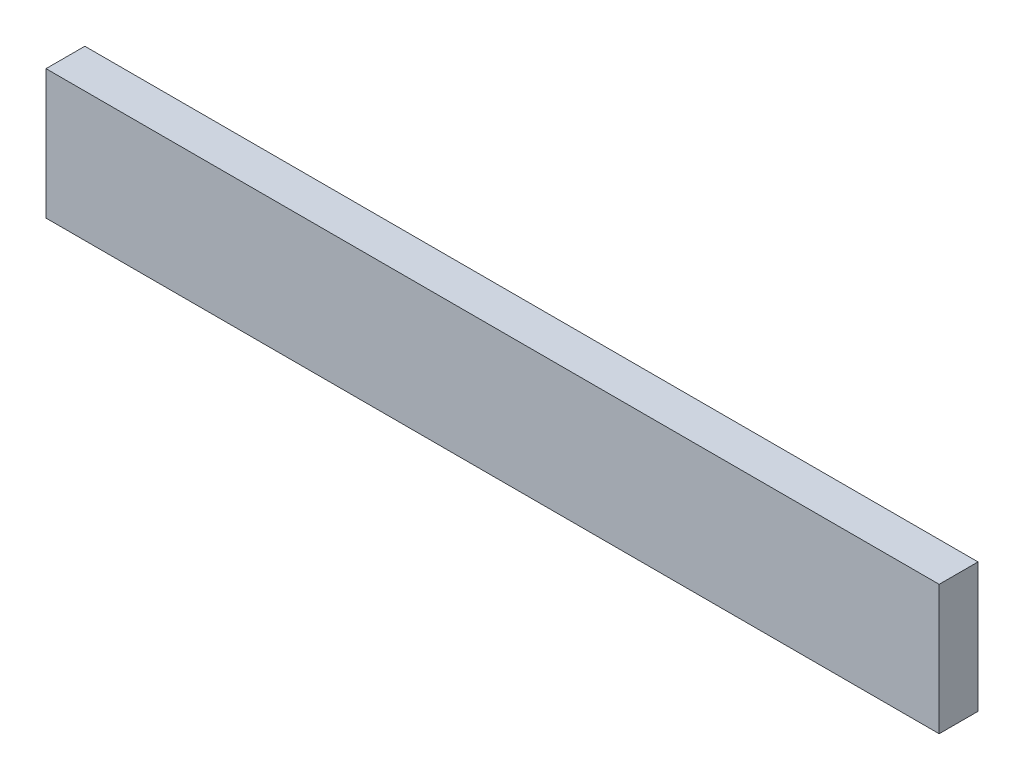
ISO-10303-21;
HEADER;
FILE_DESCRIPTION(('STEP AP214'),'2;1');
FILE_NAME('part.step','',(''),(''),'','','');
FILE_SCHEMA(('AUTOMOTIVE_DESIGN { 1 0 10303 214 1 1 1 1 }'));
ENDSEC;
DATA;
#1=APPLICATION_CONTEXT('core data for automotive mechanical design processes');
#2=APPLICATION_PROTOCOL_DEFINITION('international standard','automotive_design',2000,#1);
#3=PRODUCT_CONTEXT('',#1,'mechanical');
#4=PRODUCT('Part','Part','',(#3));
#5=PRODUCT_RELATED_PRODUCT_CATEGORY('part','',(#4));
#6=PRODUCT_DEFINITION_FORMATION('','',#4);
#7=PRODUCT_DEFINITION_CONTEXT('part definition',#1,'design');
#8=PRODUCT_DEFINITION('design','',#6,#7);
#9=PRODUCT_DEFINITION_SHAPE('','',#8);
#10=(LENGTH_UNIT() NAMED_UNIT(*) SI_UNIT(.MILLI.,.METRE.));
#11=(NAMED_UNIT(*) PLANE_ANGLE_UNIT() SI_UNIT($,.RADIAN.));
#12=(NAMED_UNIT(*) SI_UNIT($,.STERADIAN.) SOLID_ANGLE_UNIT());
#13=UNCERTAINTY_MEASURE_WITH_UNIT(LENGTH_MEASURE(1.E-05),#10,'distance_accuracy_value','');
#14=(GEOMETRIC_REPRESENTATION_CONTEXT(3) GLOBAL_UNCERTAINTY_ASSIGNED_CONTEXT((#13)) GLOBAL_UNIT_ASSIGNED_CONTEXT((#10,
#11,#12)) REPRESENTATION_CONTEXT('',''));
#15=CARTESIAN_POINT('',(0.,0.,0.));
#16=DIRECTION('',(0.,0.,1.));
#17=DIRECTION('',(1.,0.,0.));
#18=AXIS2_PLACEMENT_3D('',#15,#16,#17);
#19=CARTESIAN_POINT('',(207.,-30.,18.));
#20=DIRECTION('',(-1.,0.,0.));
#21=DIRECTION('',(0.,0.,1.));
#22=AXIS2_PLACEMENT_3D('',#19,#20,#21);
#23=PLANE('',#22);
#24=DIRECTION('',(0.,1.,0.));
#25=VECTOR('',#24,1.);
#26=CARTESIAN_POINT('',(207.,-30.,0.));
#27=LINE('',#26,#25);
#28=CARTESIAN_POINT('',(207.,-30.,0.));
#29=VERTEX_POINT('',#28);
#30=CARTESIAN_POINT('',(207.,30.,0.));
#31=VERTEX_POINT('',#30);
#32=EDGE_CURVE('E96',#29,#31,#27,.T.);
#33=ORIENTED_EDGE('',*,*,#32,.T.);
#34=DIRECTION('',(0.,0.,-1.));
#35=VECTOR('',#34,1.);
#36=CARTESIAN_POINT('',(207.,30.,18.));
#37=LINE('',#36,#35);
#38=CARTESIAN_POINT('',(207.,30.,18.));
#39=VERTEX_POINT('',#38);
#40=EDGE_CURVE('E11',#39,#31,#37,.T.);
#41=ORIENTED_EDGE('',*,*,#40,.F.);
#42=DIRECTION('',(0.,1.,0.));
#43=VECTOR('',#42,1.);
#44=CARTESIAN_POINT('',(207.,-30.,18.));
#45=LINE('',#44,#43);
#46=CARTESIAN_POINT('',(207.,-30.,18.));
#47=VERTEX_POINT('',#46);
#48=EDGE_CURVE('E84',#47,#39,#45,.T.);
#49=ORIENTED_EDGE('',*,*,#48,.F.);
#50=DIRECTION('',(0.,0.,-1.));
#51=VECTOR('',#50,1.);
#52=CARTESIAN_POINT('',(207.,-30.,18.));
#53=LINE('',#52,#51);
#54=EDGE_CURVE('E92',#47,#29,#53,.T.);
#55=ORIENTED_EDGE('',*,*,#54,.T.);
#56=EDGE_LOOP('',(#33,#41,#49,#55));
#57=FACE_BOUND('',#56,.T.);
#58=ADVANCED_FACE('F33',(#57),#23,.F.);
#59=CARTESIAN_POINT('',(-207.,30.,18.));
#60=DIRECTION('',(0.,-1.,0.));
#61=DIRECTION('',(0.,0.,-1.));
#62=AXIS2_PLACEMENT_3D('',#59,#60,#61);
#63=PLANE('',#62);
#64=DIRECTION('',(-1.,0.,0.));
#65=VECTOR('',#64,1.);
#66=CARTESIAN_POINT('',(-207.,30.,0.));
#67=LINE('',#66,#65);
#68=CARTESIAN_POINT('',(-207.,30.,0.));
#69=VERTEX_POINT('',#68);
#70=EDGE_CURVE('E88',#31,#69,#67,.T.);
#71=ORIENTED_EDGE('',*,*,#70,.T.);
#72=DIRECTION('',(0.,0.,-1.));
#73=VECTOR('',#72,1.);
#74=CARTESIAN_POINT('',(-207.,30.,18.));
#75=LINE('',#74,#73);
#76=CARTESIAN_POINT('',(-207.,30.,18.));
#77=VERTEX_POINT('',#76);
#78=EDGE_CURVE('E41',#77,#69,#75,.T.);
#79=ORIENTED_EDGE('',*,*,#78,.F.);
#80=DIRECTION('',(-1.,0.,0.));
#81=VECTOR('',#80,1.);
#82=CARTESIAN_POINT('',(-207.,30.,18.));
#83=LINE('',#82,#81);
#84=EDGE_CURVE('E79',#39,#77,#83,.T.);
#85=ORIENTED_EDGE('',*,*,#84,.F.);
#86=ORIENTED_EDGE('',*,*,#40,.T.);
#87=EDGE_LOOP('',(#71,#79,#85,#86));
#88=FACE_BOUND('',#87,.T.);
#89=ADVANCED_FACE('F87',(#88),#63,.F.);
#90=CARTESIAN_POINT('',(-207.,-30.,18.));
#91=DIRECTION('',(1.,0.,0.));
#92=DIRECTION('',(0.,0.,-1.));
#93=AXIS2_PLACEMENT_3D('',#90,#91,#92);
#94=PLANE('',#93);
#95=DIRECTION('',(0.,-1.,0.));
#96=VECTOR('',#95,1.);
#97=CARTESIAN_POINT('',(-207.,-30.,0.));
#98=LINE('',#97,#96);
#99=CARTESIAN_POINT('',(-207.,-30.,0.));
#100=VERTEX_POINT('',#99);
#101=EDGE_CURVE('E66',#69,#100,#98,.T.);
#102=ORIENTED_EDGE('',*,*,#101,.T.);
#103=DIRECTION('',(0.,0.,-1.));
#104=VECTOR('',#103,1.);
#105=CARTESIAN_POINT('',(-207.,-30.,18.));
#106=LINE('',#105,#104);
#107=CARTESIAN_POINT('',(-207.,-30.,18.));
#108=VERTEX_POINT('',#107);
#109=EDGE_CURVE('E89',#108,#100,#106,.T.);
#110=ORIENTED_EDGE('',*,*,#109,.F.);
#111=DIRECTION('',(0.,-1.,0.));
#112=VECTOR('',#111,1.);
#113=CARTESIAN_POINT('',(-207.,-30.,18.));
#114=LINE('',#113,#112);
#115=EDGE_CURVE('E82',#77,#108,#114,.T.);
#116=ORIENTED_EDGE('',*,*,#115,.F.);
#117=ORIENTED_EDGE('',*,*,#78,.T.);
#118=EDGE_LOOP('',(#102,#110,#116,#117));
#119=FACE_BOUND('',#118,.T.);
#120=ADVANCED_FACE('F90',(#119),#94,.F.);
#121=CARTESIAN_POINT('',(-207.,-30.,18.));
#122=DIRECTION('',(0.,1.,0.));
#123=DIRECTION('',(0.,0.,1.));
#124=AXIS2_PLACEMENT_3D('',#121,#122,#123);
#125=PLANE('',#124);
#126=DIRECTION('',(1.,0.,0.));
#127=VECTOR('',#126,1.);
#128=CARTESIAN_POINT('',(-207.,-30.,0.));
#129=LINE('',#128,#127);
#130=EDGE_CURVE('E72',#100,#29,#129,.T.);
#131=ORIENTED_EDGE('',*,*,#130,.T.);
#132=ORIENTED_EDGE('',*,*,#54,.F.);
#133=DIRECTION('',(1.,0.,0.));
#134=VECTOR('',#133,1.);
#135=CARTESIAN_POINT('',(-207.,-30.,18.));
#136=LINE('',#135,#134);
#137=EDGE_CURVE('E49',#108,#47,#136,.T.);
#138=ORIENTED_EDGE('',*,*,#137,.F.);
#139=ORIENTED_EDGE('',*,*,#109,.T.);
#140=EDGE_LOOP('',(#131,#132,#138,#139));
#141=FACE_BOUND('',#140,.T.);
#142=ADVANCED_FACE('F103',(#141),#125,.F.);
#143=CARTESIAN_POINT('',(0.,0.,18.));
#144=DIRECTION('',(0.,0.,-1.));
#145=DIRECTION('',(-1.,0.,0.));
#146=AXIS2_PLACEMENT_3D('',#143,#144,#145);
#147=PLANE('',#146);
#148=ORIENTED_EDGE('',*,*,#48,.T.);
#149=ORIENTED_EDGE('',*,*,#84,.T.);
#150=ORIENTED_EDGE('',*,*,#115,.T.);
#151=ORIENTED_EDGE('',*,*,#137,.T.);
#152=EDGE_LOOP('',(#148,#149,#150,#151));
#153=FACE_BOUND('',#152,.T.);
#154=ADVANCED_FACE('F80',(#153),#147,.F.);
#155=CARTESIAN_POINT('',(0.,0.,0.));
#156=DIRECTION('',(0.,0.,-1.));
#157=DIRECTION('',(-1.,0.,0.));
#158=AXIS2_PLACEMENT_3D('',#155,#156,#157);
#159=PLANE('',#158);
#160=ORIENTED_EDGE('',*,*,#32,.F.);
#161=ORIENTED_EDGE('',*,*,#130,.F.);
#162=ORIENTED_EDGE('',*,*,#101,.F.);
#163=ORIENTED_EDGE('',*,*,#70,.F.);
#164=EDGE_LOOP('',(#160,#161,#162,#163));
#165=FACE_BOUND('',#164,.T.);
#166=ADVANCED_FACE('F106',(#165),#159,.T.);
#167=CLOSED_SHELL('',(#58,#89,#120,#142,#154,#166));
#168=MANIFOLD_SOLID_BREP('B2',#167);
#169=ADVANCED_BREP_SHAPE_REPRESENTATION('',(#18,#168),#14);
#170=SHAPE_DEFINITION_REPRESENTATION(#9,#169);
ENDSEC;
END-ISO-10303-21;
